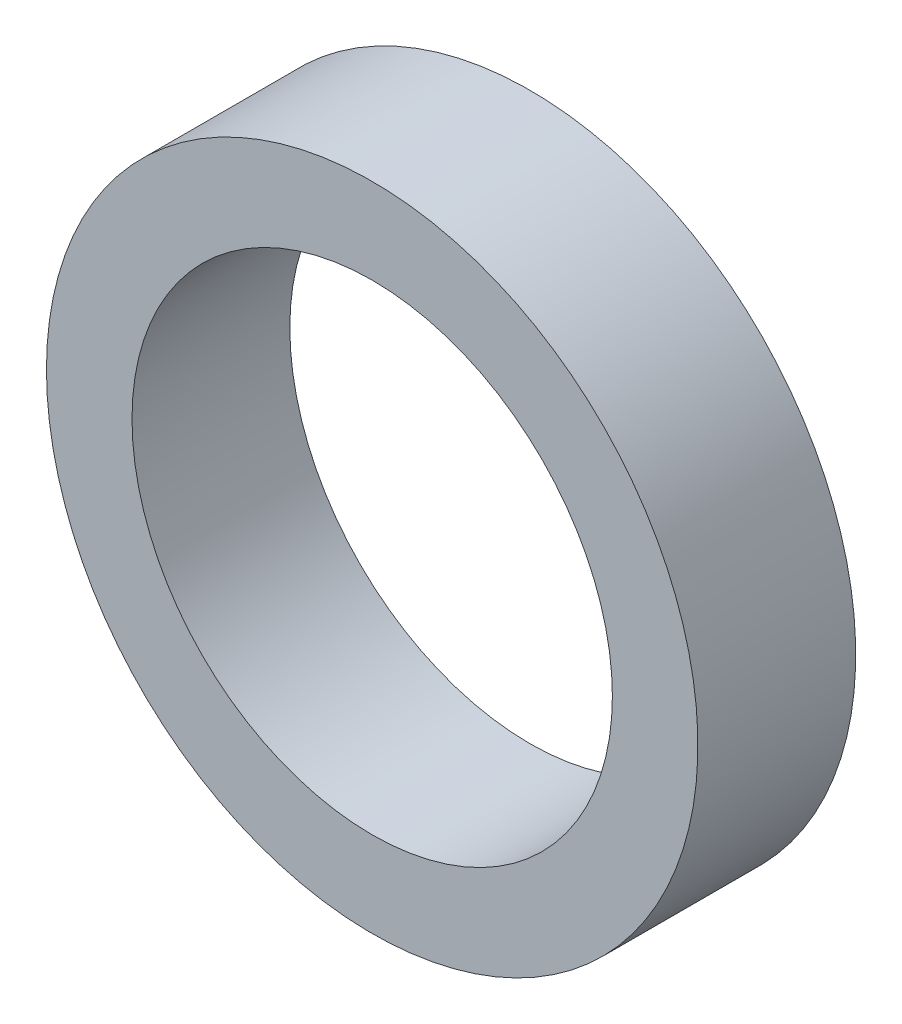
ISO-10303-21;
HEADER;
FILE_DESCRIPTION(('STEP AP214'),'2;1');
FILE_NAME('part.step','',(''),(''),'','','');
FILE_SCHEMA(('AUTOMOTIVE_DESIGN { 1 0 10303 214 1 1 1 1 }'));
ENDSEC;
DATA;
#1=APPLICATION_CONTEXT('core data for automotive mechanical design processes');
#2=APPLICATION_PROTOCOL_DEFINITION('international standard','automotive_design',2000,#1);
#3=PRODUCT_CONTEXT('',#1,'mechanical');
#4=PRODUCT('Part','Part','',(#3));
#5=PRODUCT_RELATED_PRODUCT_CATEGORY('part','',(#4));
#6=PRODUCT_DEFINITION_FORMATION('','',#4);
#7=PRODUCT_DEFINITION_CONTEXT('part definition',#1,'design');
#8=PRODUCT_DEFINITION('design','',#6,#7);
#9=PRODUCT_DEFINITION_SHAPE('','',#8);
#10=(LENGTH_UNIT() NAMED_UNIT(*) SI_UNIT(.MILLI.,.METRE.));
#11=(NAMED_UNIT(*) PLANE_ANGLE_UNIT() SI_UNIT($,.RADIAN.));
#12=(NAMED_UNIT(*) SI_UNIT($,.STERADIAN.) SOLID_ANGLE_UNIT());
#13=UNCERTAINTY_MEASURE_WITH_UNIT(LENGTH_MEASURE(1.E-05),#10,'distance_accuracy_value','');
#14=(GEOMETRIC_REPRESENTATION_CONTEXT(3) GLOBAL_UNCERTAINTY_ASSIGNED_CONTEXT((#13)) GLOBAL_UNIT_ASSIGNED_CONTEXT((#10,
#11,#12)) REPRESENTATION_CONTEXT('',''));
#15=CARTESIAN_POINT('',(0.,0.,0.));
#16=DIRECTION('',(0.,0.,1.));
#17=DIRECTION('',(1.,0.,0.));
#18=AXIS2_PLACEMENT_3D('',#15,#16,#17);
#19=CARTESIAN_POINT('',(0.,0.,6.35));
#20=DIRECTION('',(0.,0.,-1.));
#21=DIRECTION('',(-1.,0.,0.));
#22=AXIS2_PLACEMENT_3D('',#19,#20,#21);
#23=CYLINDRICAL_SURFACE('',#22,9.6647);
#24=CARTESIAN_POINT('',(0.,0.,0.));
#25=DIRECTION('',(0.,0.,-1.));
#26=DIRECTION('',(-1.,0.,0.));
#27=AXIS2_PLACEMENT_3D('',#24,#25,#26);
#28=CIRCLE('',#27,9.6647);
#29=CARTESIAN_POINT('',(-9.6647,0.,0.));
#30=VERTEX_POINT('',#29);
#31=EDGE_CURVE('E24',#30,#30,#28,.T.);
#32=ORIENTED_EDGE('',*,*,#31,.T.);
#33=EDGE_LOOP('',(#32));
#34=FACE_BOUND('',#33,.T.);
#35=CARTESIAN_POINT('',(0.,0.,6.35));
#36=DIRECTION('',(0.,0.,-1.));
#37=DIRECTION('',(-1.,0.,0.));
#38=AXIS2_PLACEMENT_3D('',#35,#36,#37);
#39=CIRCLE('',#38,9.6647);
#40=CARTESIAN_POINT('',(-9.6647,0.,6.35));
#41=VERTEX_POINT('',#40);
#42=EDGE_CURVE('E15',#41,#41,#39,.T.);
#43=ORIENTED_EDGE('',*,*,#42,.F.);
#44=EDGE_LOOP('',(#43));
#45=FACE_BOUND('',#44,.T.);
#46=ADVANCED_FACE('F12',(#34,#45),#23,.F.);
#47=CARTESIAN_POINT('',(0.,0.,6.35));
#48=DIRECTION('',(0.,0.,1.));
#49=DIRECTION('',(1.,0.,0.));
#50=AXIS2_PLACEMENT_3D('',#47,#48,#49);
#51=PLANE('',#50);
#52=ORIENTED_EDGE('',*,*,#42,.T.);
#53=EDGE_LOOP('',(#52));
#54=FACE_BOUND('',#53,.T.);
#55=CARTESIAN_POINT('',(0.,0.,6.35));
#56=DIRECTION('',(0.,0.,-1.));
#57=DIRECTION('',(-1.,0.,0.));
#58=AXIS2_PLACEMENT_3D('',#55,#56,#57);
#59=CIRCLE('',#58,13.1064);
#60=CARTESIAN_POINT('',(-13.1064,0.,6.35));
#61=VERTEX_POINT('',#60);
#62=EDGE_CURVE('E19',#61,#61,#59,.T.);
#63=ORIENTED_EDGE('',*,*,#62,.F.);
#64=EDGE_LOOP('',(#63));
#65=FACE_BOUND('',#64,.T.);
#66=ADVANCED_FACE('F32',(#54,#65),#51,.T.);
#67=CARTESIAN_POINT('',(0.,0.,0.));
#68=DIRECTION('',(0.,0.,1.));
#69=DIRECTION('',(1.,0.,0.));
#70=AXIS2_PLACEMENT_3D('',#67,#68,#69);
#71=PLANE('',#70);
#72=ORIENTED_EDGE('',*,*,#31,.F.);
#73=EDGE_LOOP('',(#72));
#74=FACE_BOUND('',#73,.T.);
#75=CARTESIAN_POINT('',(0.,0.,0.));
#76=DIRECTION('',(0.,0.,-1.));
#77=DIRECTION('',(-1.,0.,0.));
#78=AXIS2_PLACEMENT_3D('',#75,#76,#77);
#79=CIRCLE('',#78,13.1064);
#80=CARTESIAN_POINT('',(-13.1064,0.,0.));
#81=VERTEX_POINT('',#80);
#82=EDGE_CURVE('E8',#81,#81,#79,.F.);
#83=ORIENTED_EDGE('',*,*,#82,.F.);
#84=EDGE_LOOP('',(#83));
#85=FACE_BOUND('',#84,.T.);
#86=ADVANCED_FACE('F40',(#74,#85),#71,.F.);
#87=CARTESIAN_POINT('',(0.,0.,6.35));
#88=DIRECTION('',(0.,0.,-1.));
#89=DIRECTION('',(-1.,0.,0.));
#90=AXIS2_PLACEMENT_3D('',#87,#88,#89);
#91=CYLINDRICAL_SURFACE('',#90,13.1064);
#92=ORIENTED_EDGE('',*,*,#82,.T.);
#93=EDGE_LOOP('',(#92));
#94=FACE_BOUND('',#93,.T.);
#95=ORIENTED_EDGE('',*,*,#62,.T.);
#96=EDGE_LOOP('',(#95));
#97=FACE_BOUND('',#96,.T.);
#98=ADVANCED_FACE('F41',(#94,#97),#91,.T.);
#99=CLOSED_SHELL('',(#46,#66,#86,#98));
#100=MANIFOLD_SOLID_BREP('B1',#99);
#101=ADVANCED_BREP_SHAPE_REPRESENTATION('',(#18,#100),#14);
#102=SHAPE_DEFINITION_REPRESENTATION(#9,#101);
ENDSEC;
END-ISO-10303-21;
